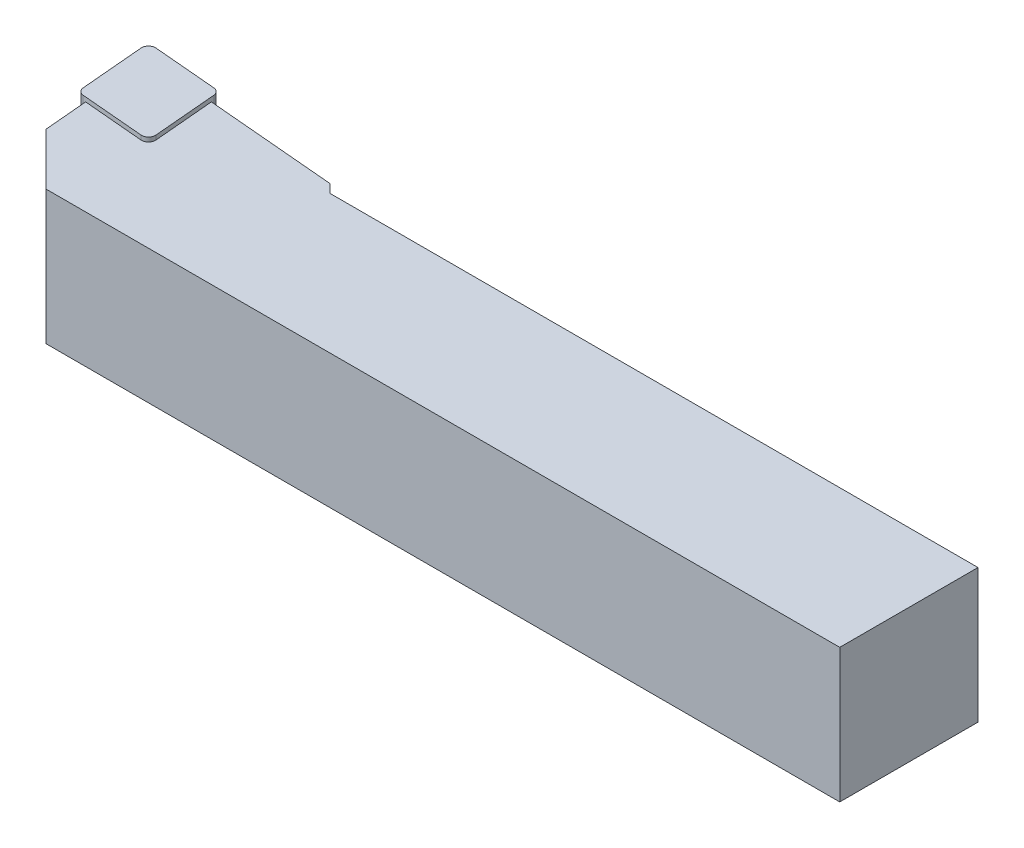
ISO-10303-21;
HEADER;
FILE_DESCRIPTION(('STEP AP214'),'2;1');
FILE_NAME('part.step','',(''),(''),'','','');
FILE_SCHEMA(('AUTOMOTIVE_DESIGN { 1 0 10303 214 1 1 1 1 }'));
ENDSEC;
DATA;
#1=APPLICATION_CONTEXT('core data for automotive mechanical design processes');
#2=APPLICATION_PROTOCOL_DEFINITION('international standard','automotive_design',2000,#1);
#3=PRODUCT_CONTEXT('',#1,'mechanical');
#4=PRODUCT('Part','Part','',(#3));
#5=PRODUCT_RELATED_PRODUCT_CATEGORY('part','',(#4));
#6=PRODUCT_DEFINITION_FORMATION('','',#4);
#7=PRODUCT_DEFINITION_CONTEXT('part definition',#1,'design');
#8=PRODUCT_DEFINITION('design','',#6,#7);
#9=PRODUCT_DEFINITION_SHAPE('','',#8);
#10=(LENGTH_UNIT() NAMED_UNIT(*) SI_UNIT(.MILLI.,.METRE.));
#11=(NAMED_UNIT(*) PLANE_ANGLE_UNIT() SI_UNIT($,.RADIAN.));
#12=(NAMED_UNIT(*) SI_UNIT($,.STERADIAN.) SOLID_ANGLE_UNIT());
#13=UNCERTAINTY_MEASURE_WITH_UNIT(LENGTH_MEASURE(1.E-05),#10,'distance_accuracy_value','');
#14=(GEOMETRIC_REPRESENTATION_CONTEXT(3) GLOBAL_UNCERTAINTY_ASSIGNED_CONTEXT((#13)) GLOBAL_UNIT_ASSIGNED_CONTEXT((#10,
#11,#12)) REPRESENTATION_CONTEXT('',''));
#15=CARTESIAN_POINT('',(0.,0.,0.));
#16=DIRECTION('',(0.,0.,1.));
#17=DIRECTION('',(1.,0.,0.));
#18=AXIS2_PLACEMENT_3D('',#15,#16,#17);
#19=CARTESIAN_POINT('',(0.800000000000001,-4.76,0.8));
#20=DIRECTION('',(0.,1.,0.));
#21=DIRECTION('',(0.,0.,1.));
#22=AXIS2_PLACEMENT_3D('',#19,#20,#21);
#23=CYLINDRICAL_SURFACE('',#22,0.8);
#24=CARTESIAN_POINT('',(0.800000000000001,0.,0.8));
#25=DIRECTION('',(0.,1.,0.));
#26=DIRECTION('',(0.,0.,1.));
#27=AXIS2_PLACEMENT_3D('',#24,#25,#26);
#28=CIRCLE('',#27,0.8);
#29=CARTESIAN_POINT('',(0.869724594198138,0.,0.00304424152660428));
#30=VERTEX_POINT('',#29);
#31=CARTESIAN_POINT('',(0.00304424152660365,0.,0.869724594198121));
#32=VERTEX_POINT('',#31);
#33=EDGE_CURVE('E138',#30,#32,#28,.T.);
#34=ORIENTED_EDGE('',*,*,#33,.F.);
#35=DIRECTION('',(0.,1.,0.));
#36=VECTOR('',#35,1.);
#37=CARTESIAN_POINT('',(0.869724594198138,-4.76,0.00304424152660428));
#38=LINE('',#37,#36);
#39=CARTESIAN_POINT('',(0.869724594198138,-4.76,0.00304424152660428));
#40=VERTEX_POINT('',#39);
#41=EDGE_CURVE('E54',#40,#30,#38,.T.);
#42=ORIENTED_EDGE('',*,*,#41,.F.);
#43=CARTESIAN_POINT('',(0.800000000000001,-4.76,0.8));
#44=DIRECTION('',(0.,1.,0.));
#45=DIRECTION('',(0.,0.,1.));
#46=AXIS2_PLACEMENT_3D('',#43,#44,#45);
#47=CIRCLE('',#46,0.8);
#48=CARTESIAN_POINT('',(0.00304424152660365,-4.76,0.869724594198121));
#49=VERTEX_POINT('',#48);
#50=EDGE_CURVE('E160',#40,#49,#47,.T.);
#51=ORIENTED_EDGE('',*,*,#50,.T.);
#52=DIRECTION('',(0.,1.,0.));
#53=VECTOR('',#52,1.);
#54=CARTESIAN_POINT('',(0.00304424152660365,-4.76,0.869724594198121));
#55=LINE('',#54,#53);
#56=EDGE_CURVE('E93',#49,#32,#55,.T.);
#57=ORIENTED_EDGE('',*,*,#56,.T.);
#58=EDGE_LOOP('',(#34,#42,#51,#57));
#59=FACE_BOUND('',#58,.T.);
#60=ADVANCED_FACE('F31',(#59),#23,.T.);
#61=CARTESIAN_POINT('',(0.869724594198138,-4.76,0.00304424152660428));
#62=DIRECTION('',(0.0871557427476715,0.,-0.996194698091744));
#63=DIRECTION('',(-0.996194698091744,0.,-0.0871557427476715));
#64=AXIS2_PLACEMENT_3D('',#61,#62,#63);
#65=PLANE('',#64);
#66=DIRECTION('',(-0.996194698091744,0.,-0.0871557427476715));
#67=VECTOR('',#66,1.);
#68=CARTESIAN_POINT('',(0.869724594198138,0.,0.00304424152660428));
#69=LINE('',#68,#67);
#70=CARTESIAN_POINT('',(8.21697670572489,0.,0.645845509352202));
#71=VERTEX_POINT('',#70);
#72=EDGE_CURVE('E157',#71,#30,#69,.T.);
#73=ORIENTED_EDGE('',*,*,#72,.F.);
#74=DIRECTION('',(0.,1.,0.));
#75=VECTOR('',#74,1.);
#76=CARTESIAN_POINT('',(8.21697670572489,-4.76,0.645845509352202));
#77=LINE('',#76,#75);
#78=CARTESIAN_POINT('',(8.21697670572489,-4.76,0.645845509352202));
#79=VERTEX_POINT('',#78);
#80=EDGE_CURVE('E129',#79,#71,#77,.T.);
#81=ORIENTED_EDGE('',*,*,#80,.F.);
#82=DIRECTION('',(-0.996194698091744,0.,-0.0871557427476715));
#83=VECTOR('',#82,1.);
#84=CARTESIAN_POINT('',(0.869724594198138,-4.76,0.00304424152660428));
#85=LINE('',#84,#83);
#86=EDGE_CURVE('E133',#79,#40,#85,.T.);
#87=ORIENTED_EDGE('',*,*,#86,.T.);
#88=ORIENTED_EDGE('',*,*,#41,.T.);
#89=EDGE_LOOP('',(#73,#81,#87,#88));
#90=FACE_BOUND('',#89,.T.);
#91=ADVANCED_FACE('F333',(#90),#65,.T.);
#92=CARTESIAN_POINT('',(8.14725211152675,-4.76,1.4428012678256));
#93=DIRECTION('',(0.,1.,0.));
#94=DIRECTION('',(0.,0.,1.));
#95=AXIS2_PLACEMENT_3D('',#92,#93,#94);
#96=CYLINDRICAL_SURFACE('',#95,0.799999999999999);
#97=CARTESIAN_POINT('',(8.14725211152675,0.,1.4428012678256));
#98=DIRECTION('',(0.,1.,0.));
#99=DIRECTION('',(0.,0.,-1.));
#100=AXIS2_PLACEMENT_3D('',#97,#98,#99);
#101=CIRCLE('',#100,0.799999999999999);
#102=CARTESIAN_POINT('',(8.94420787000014,0.,1.37307667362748));
#103=VERTEX_POINT('',#102);
#104=EDGE_CURVE('E127',#103,#71,#101,.T.);
#105=ORIENTED_EDGE('',*,*,#104,.F.);
#106=DIRECTION('',(0.,1.,0.));
#107=VECTOR('',#106,1.);
#108=CARTESIAN_POINT('',(8.94420787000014,-4.76,1.37307667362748));
#109=LINE('',#108,#107);
#110=CARTESIAN_POINT('',(8.94420787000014,-4.76,1.37307667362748));
#111=VERTEX_POINT('',#110);
#112=EDGE_CURVE('E110',#111,#103,#109,.T.);
#113=ORIENTED_EDGE('',*,*,#112,.F.);
#114=CARTESIAN_POINT('',(8.14725211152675,-4.76,1.4428012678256));
#115=DIRECTION('',(0.,1.,0.));
#116=DIRECTION('',(0.,0.,-1.));
#117=AXIS2_PLACEMENT_3D('',#114,#115,#116);
#118=CIRCLE('',#117,0.799999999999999);
#119=EDGE_CURVE('E119',#111,#79,#118,.T.);
#120=ORIENTED_EDGE('',*,*,#119,.T.);
#121=ORIENTED_EDGE('',*,*,#80,.T.);
#122=EDGE_LOOP('',(#105,#113,#120,#121));
#123=FACE_BOUND('',#122,.T.);
#124=ADVANCED_FACE('F124',(#123),#96,.T.);
#125=CARTESIAN_POINT('',(8.94420787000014,-4.76,1.37307667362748));
#126=DIRECTION('',(0.996194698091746,0.,-0.0871557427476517));
#127=DIRECTION('',(-0.0871557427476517,0.,-0.996194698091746));
#128=AXIS2_PLACEMENT_3D('',#125,#126,#127);
#129=PLANE('',#128);
#130=DIRECTION('',(0.,1.,0.));
#131=VECTOR('',#130,1.);
#132=CARTESIAN_POINT('',(8.97259223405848,-4.76,1.69751143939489));
#133=LINE('',#132,#131);
#134=CARTESIAN_POINT('',(8.97259223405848,-4.76,1.69751143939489));
#135=VERTEX_POINT('',#134);
#136=CARTESIAN_POINT('',(8.97259223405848,-0.5,1.69751143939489));
#137=VERTEX_POINT('',#136);
#138=EDGE_CURVE('E115',#135,#137,#133,.T.);
#139=ORIENTED_EDGE('',*,*,#138,.F.);
#140=DIRECTION('',(-0.0871557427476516,0.,-0.996194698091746));
#141=VECTOR('',#140,1.);
#142=CARTESIAN_POINT('',(8.94420787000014,-4.76,1.37307667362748));
#143=LINE('',#142,#141);
#144=EDGE_CURVE('E106',#135,#111,#143,.T.);
#145=ORIENTED_EDGE('',*,*,#144,.T.);
#146=ORIENTED_EDGE('',*,*,#112,.T.);
#147=DIRECTION('',(-0.0871557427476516,0.,-0.996194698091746));
#148=VECTOR('',#147,1.);
#149=CARTESIAN_POINT('',(8.94420787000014,0.,1.37307667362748));
#150=LINE('',#149,#148);
#151=CARTESIAN_POINT('',(9.58700913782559,0.,8.72032878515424));
#152=VERTEX_POINT('',#151);
#153=EDGE_CURVE('E154',#152,#103,#150,.T.);
#154=ORIENTED_EDGE('',*,*,#153,.F.);
#155=DIRECTION('',(0.,1.,0.));
#156=VECTOR('',#155,1.);
#157=CARTESIAN_POINT('',(9.58700913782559,-4.76,8.72032878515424));
#158=LINE('',#157,#156);
#159=CARTESIAN_POINT('',(9.58700913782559,-0.5,8.72032878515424));
#160=VERTEX_POINT('',#159);
#161=EDGE_CURVE('E130',#160,#152,#158,.T.);
#162=ORIENTED_EDGE('',*,*,#161,.F.);
#163=DIRECTION('',(0.0871557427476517,0.,0.996194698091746));
#164=VECTOR('',#163,1.);
#165=CARTESIAN_POINT('',(8.94420787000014,-0.5,1.37307667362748));
#166=LINE('',#165,#164);
#167=EDGE_CURVE('E142',#137,#160,#166,.T.);
#168=ORIENTED_EDGE('',*,*,#167,.F.);
#169=EDGE_LOOP('',(#139,#145,#146,#154,#162,#168));
#170=FACE_BOUND('',#169,.T.);
#171=ADVANCED_FACE('F108',(#170),#129,.T.);
#172=CARTESIAN_POINT('',(8.7900533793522,-4.76,8.79005337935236));
#173=DIRECTION('',(0.,1.,0.));
#174=DIRECTION('',(0.,0.,1.));
#175=AXIS2_PLACEMENT_3D('',#172,#173,#174);
#176=CYLINDRICAL_SURFACE('',#175,0.799999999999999);
#177=CARTESIAN_POINT('',(8.7900533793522,-0.5,8.79005337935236));
#178=DIRECTION('',(0.,1.,0.));
#179=DIRECTION('',(0.,0.,1.));
#180=AXIS2_PLACEMENT_3D('',#177,#178,#179);
#181=CIRCLE('',#180,0.799999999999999);
#182=CARTESIAN_POINT('',(8.72032878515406,-0.5,9.58700913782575));
#183=VERTEX_POINT('',#182);
#184=EDGE_CURVE('E197',#160,#183,#181,.F.);
#185=ORIENTED_EDGE('',*,*,#184,.F.);
#186=ORIENTED_EDGE('',*,*,#161,.T.);
#187=CARTESIAN_POINT('',(8.7900533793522,0.,8.79005337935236));
#188=DIRECTION('',(0.,1.,0.));
#189=DIRECTION('',(0.,0.,-1.));
#190=AXIS2_PLACEMENT_3D('',#187,#188,#189);
#191=CIRCLE('',#190,0.799999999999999);
#192=CARTESIAN_POINT('',(8.72032878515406,0.,9.58700913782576));
#193=VERTEX_POINT('',#192);
#194=EDGE_CURVE('E151',#193,#152,#191,.T.);
#195=ORIENTED_EDGE('',*,*,#194,.F.);
#196=DIRECTION('',(0.,1.,0.));
#197=VECTOR('',#196,1.);
#198=CARTESIAN_POINT('',(8.72032878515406,-4.76,9.58700913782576));
#199=LINE('',#198,#197);
#200=EDGE_CURVE('E165',#183,#193,#199,.T.);
#201=ORIENTED_EDGE('',*,*,#200,.F.);
#202=EDGE_LOOP('',(#185,#186,#195,#201));
#203=FACE_BOUND('',#202,.T.);
#204=ADVANCED_FACE('F325',(#203),#176,.T.);
#205=CARTESIAN_POINT('',(8.72032878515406,-4.76,9.58700913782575));
#206=DIRECTION('',(-0.0871557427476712,0.,0.996194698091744));
#207=DIRECTION('',(0.996194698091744,0.,0.0871557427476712));
#208=AXIS2_PLACEMENT_3D('',#205,#206,#207);
#209=PLANE('',#208);
#210=DIRECTION('',(0.,-1.,0.));
#211=VECTOR('',#210,1.);
#212=CARTESIAN_POINT('',(1.69751143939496,-4.76,8.97259223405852));
#213=LINE('',#212,#211);
#214=CARTESIAN_POINT('',(1.69751143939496,-0.5,8.97259223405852));
#215=VERTEX_POINT('',#214);
#216=CARTESIAN_POINT('',(1.69751143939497,-4.76,8.97259223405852));
#217=VERTEX_POINT('',#216);
#218=EDGE_CURVE('E187',#215,#217,#213,.T.);
#219=ORIENTED_EDGE('',*,*,#218,.F.);
#220=DIRECTION('',(-0.996194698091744,0.,-0.0871557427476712));
#221=VECTOR('',#220,1.);
#222=CARTESIAN_POINT('',(8.72032878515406,-0.5,9.58700913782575));
#223=LINE('',#222,#221);
#224=EDGE_CURVE('E11',#183,#215,#223,.T.);
#225=ORIENTED_EDGE('',*,*,#224,.F.);
#226=ORIENTED_EDGE('',*,*,#200,.T.);
#227=DIRECTION('',(0.996194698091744,0.,0.0871557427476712));
#228=VECTOR('',#227,1.);
#229=CARTESIAN_POINT('',(8.72032878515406,0.,9.58700913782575));
#230=LINE('',#229,#228);
#231=CARTESIAN_POINT('',(1.37307667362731,0.,8.94420787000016));
#232=VERTEX_POINT('',#231);
#233=EDGE_CURVE('E148',#232,#193,#230,.T.);
#234=ORIENTED_EDGE('',*,*,#233,.F.);
#235=DIRECTION('',(0.,1.,0.));
#236=VECTOR('',#235,1.);
#237=CARTESIAN_POINT('',(1.37307667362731,-4.76,8.94420787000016));
#238=LINE('',#237,#236);
#239=CARTESIAN_POINT('',(1.37307667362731,-4.76,8.94420787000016));
#240=VERTEX_POINT('',#239);
#241=EDGE_CURVE('E167',#240,#232,#238,.T.);
#242=ORIENTED_EDGE('',*,*,#241,.F.);
#243=DIRECTION('',(0.996194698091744,0.,0.0871557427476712));
#244=VECTOR('',#243,1.);
#245=CARTESIAN_POINT('',(8.72032878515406,-4.76,9.58700913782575));
#246=LINE('',#245,#244);
#247=EDGE_CURVE('E120',#240,#217,#246,.T.);
#248=ORIENTED_EDGE('',*,*,#247,.T.);
#249=EDGE_LOOP('',(#219,#225,#226,#234,#242,#248));
#250=FACE_BOUND('',#249,.T.);
#251=ADVANCED_FACE('F185',(#250),#209,.T.);
#252=CARTESIAN_POINT('',(1.44280126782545,-4.76,8.14725211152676));
#253=DIRECTION('',(0.,1.,0.));
#254=DIRECTION('',(0.,0.,1.));
#255=AXIS2_PLACEMENT_3D('',#252,#253,#254);
#256=CYLINDRICAL_SURFACE('',#255,0.8);
#257=CARTESIAN_POINT('',(1.44280126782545,0.,8.14725211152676));
#258=DIRECTION('',(0.,1.,0.));
#259=DIRECTION('',(0.,0.,-1.));
#260=AXIS2_PLACEMENT_3D('',#257,#258,#259);
#261=CIRCLE('',#260,0.8);
#262=CARTESIAN_POINT('',(0.645845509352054,0.,8.21697670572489));
#263=VERTEX_POINT('',#262);
#264=EDGE_CURVE('E145',#263,#232,#261,.T.);
#265=ORIENTED_EDGE('',*,*,#264,.F.);
#266=DIRECTION('',(0.,1.,0.));
#267=VECTOR('',#266,1.);
#268=CARTESIAN_POINT('',(0.645845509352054,-4.76,8.21697670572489));
#269=LINE('',#268,#267);
#270=CARTESIAN_POINT('',(0.645845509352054,-4.76,8.21697670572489));
#271=VERTEX_POINT('',#270);
#272=EDGE_CURVE('E169',#271,#263,#269,.T.);
#273=ORIENTED_EDGE('',*,*,#272,.F.);
#274=CARTESIAN_POINT('',(1.44280126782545,-4.76,8.14725211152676));
#275=DIRECTION('',(0.,1.,0.));
#276=DIRECTION('',(0.,0.,-1.));
#277=AXIS2_PLACEMENT_3D('',#274,#275,#276);
#278=CIRCLE('',#277,0.8);
#279=EDGE_CURVE('E189',#271,#240,#278,.T.);
#280=ORIENTED_EDGE('',*,*,#279,.T.);
#281=ORIENTED_EDGE('',*,*,#241,.T.);
#282=EDGE_LOOP('',(#265,#273,#280,#281));
#283=FACE_BOUND('',#282,.T.);
#284=ADVANCED_FACE('F331',(#283),#256,.T.);
#285=CARTESIAN_POINT('',(0.645845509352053,-4.76,8.21697670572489));
#286=DIRECTION('',(-0.996194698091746,0.,0.0871557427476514));
#287=DIRECTION('',(0.0871557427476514,0.,0.996194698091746));
#288=AXIS2_PLACEMENT_3D('',#285,#286,#287);
#289=PLANE('',#288);
#290=DIRECTION('',(0.0871557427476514,0.,0.996194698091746));
#291=VECTOR('',#290,1.);
#292=CARTESIAN_POINT('',(0.645845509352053,0.,8.21697670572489));
#293=LINE('',#292,#291);
#294=EDGE_CURVE('E141',#32,#263,#293,.T.);
#295=ORIENTED_EDGE('',*,*,#294,.F.);
#296=ORIENTED_EDGE('',*,*,#56,.F.);
#297=DIRECTION('',(0.0871557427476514,0.,0.996194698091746));
#298=VECTOR('',#297,1.);
#299=CARTESIAN_POINT('',(0.645845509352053,-4.76,8.21697670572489));
#300=LINE('',#299,#298);
#301=EDGE_CURVE('E190',#49,#271,#300,.T.);
#302=ORIENTED_EDGE('',*,*,#301,.T.);
#303=ORIENTED_EDGE('',*,*,#272,.T.);
#304=EDGE_LOOP('',(#295,#296,#302,#303));
#305=FACE_BOUND('',#304,.T.);
#306=ADVANCED_FACE('F332',(#305),#289,.T.);
#307=CARTESIAN_POINT('',(0.800000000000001,-4.76,0.8));
#308=DIRECTION('',(0.,1.,0.));
#309=DIRECTION('',(0.,0.,1.));
#310=AXIS2_PLACEMENT_3D('',#307,#308,#309);
#311=PLANE('',#310);
#312=DIRECTION('',(-0.996194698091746,0.,-0.0871557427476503));
#313=VECTOR('',#312,1.);
#314=CARTESIAN_POINT('',(0.784154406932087,-4.76,0.981115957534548));
#315=LINE('',#314,#313);
#316=CARTESIAN_POINT('',(0.999999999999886,-4.76,1.00000000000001));
#317=VERTEX_POINT('',#316);
#318=EDGE_CURVE('E162',#135,#317,#315,.T.);
#319=ORIENTED_EDGE('',*,*,#318,.T.);
#320=DIRECTION('',(0.0871557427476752,0.,0.996194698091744));
#321=VECTOR('',#320,1.);
#322=CARTESIAN_POINT('',(0.98111595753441,-4.76,0.784154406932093));
#323=LINE('',#322,#321);
#324=EDGE_CURVE('E38',#317,#217,#323,.T.);
#325=ORIENTED_EDGE('',*,*,#324,.T.);
#326=ORIENTED_EDGE('',*,*,#247,.F.);
#327=ORIENTED_EDGE('',*,*,#279,.F.);
#328=ORIENTED_EDGE('',*,*,#301,.F.);
#329=ORIENTED_EDGE('',*,*,#50,.F.);
#330=ORIENTED_EDGE('',*,*,#86,.F.);
#331=ORIENTED_EDGE('',*,*,#119,.F.);
#332=ORIENTED_EDGE('',*,*,#144,.F.);
#333=EDGE_LOOP('',(#319,#325,#326,#327,#328,#329,#330,#331,#332));
#334=FACE_BOUND('',#333,.T.);
#335=ADVANCED_FACE('F132',(#334),#311,.F.);
#336=CARTESIAN_POINT('',(0.800000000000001,0.,0.8));
#337=DIRECTION('',(0.,1.,0.));
#338=DIRECTION('',(0.,0.,1.));
#339=AXIS2_PLACEMENT_3D('',#336,#337,#338);
#340=PLANE('',#339);
#341=ORIENTED_EDGE('',*,*,#33,.T.);
#342=ORIENTED_EDGE('',*,*,#294,.T.);
#343=ORIENTED_EDGE('',*,*,#264,.T.);
#344=ORIENTED_EDGE('',*,*,#233,.T.);
#345=ORIENTED_EDGE('',*,*,#194,.T.);
#346=ORIENTED_EDGE('',*,*,#153,.T.);
#347=ORIENTED_EDGE('',*,*,#104,.T.);
#348=ORIENTED_EDGE('',*,*,#72,.T.);
#349=EDGE_LOOP('',(#341,#342,#343,#344,#345,#346,#347,#348));
#350=FACE_BOUND('',#349,.T.);
#351=ADVANCED_FACE('F328',(#350),#340,.T.);
#352=CARTESIAN_POINT('',(100.,-16.,4.));
#353=DIRECTION('',(0.,0.,-1.));
#354=DIRECTION('',(-1.,0.,0.));
#355=AXIS2_PLACEMENT_3D('',#352,#353,#354);
#356=PLANE('',#355);
#357=DIRECTION('',(-1.,0.,0.));
#358=VECTOR('',#357,1.);
#359=CARTESIAN_POINT('',(100.,-0.5,4.));
#360=LINE('',#359,#358);
#361=CARTESIAN_POINT('',(100.,-0.5,4.));
#362=VERTEX_POINT('',#361);
#363=CARTESIAN_POINT('',(25.,-0.5,4.));
#364=VERTEX_POINT('',#363);
#365=EDGE_CURVE('E241',#362,#364,#360,.T.);
#366=ORIENTED_EDGE('',*,*,#365,.F.);
#367=DIRECTION('',(0.,1.,0.));
#368=VECTOR('',#367,1.);
#369=CARTESIAN_POINT('',(100.,-16.,4.));
#370=LINE('',#369,#368);
#371=CARTESIAN_POINT('',(100.,-16.,4.));
#372=VERTEX_POINT('',#371);
#373=EDGE_CURVE('E202',#372,#362,#370,.T.);
#374=ORIENTED_EDGE('',*,*,#373,.F.);
#375=DIRECTION('',(-1.,0.,0.));
#376=VECTOR('',#375,1.);
#377=CARTESIAN_POINT('',(100.,-16.,4.));
#378=LINE('',#377,#376);
#379=CARTESIAN_POINT('',(25.,-16.,4.));
#380=VERTEX_POINT('',#379);
#381=EDGE_CURVE('E225',#372,#380,#378,.T.);
#382=ORIENTED_EDGE('',*,*,#381,.T.);
#383=DIRECTION('',(0.,1.,0.));
#384=VECTOR('',#383,1.);
#385=CARTESIAN_POINT('',(25.,-16.,4.));
#386=LINE('',#385,#384);
#387=EDGE_CURVE('E203',#380,#364,#386,.T.);
#388=ORIENTED_EDGE('',*,*,#387,.T.);
#389=EDGE_LOOP('',(#366,#374,#382,#388));
#390=FACE_BOUND('',#389,.T.);
#391=ADVANCED_FACE('F266',(#390),#356,.T.);
#392=CARTESIAN_POINT('',(100.,-16.,4.));
#393=DIRECTION('',(1.,0.,0.));
#394=DIRECTION('',(0.,0.,-1.));
#395=AXIS2_PLACEMENT_3D('',#392,#393,#394);
#396=PLANE('',#395);
#397=DIRECTION('',(0.,0.,-1.));
#398=VECTOR('',#397,1.);
#399=CARTESIAN_POINT('',(100.,-0.5,4.));
#400=LINE('',#399,#398);
#401=CARTESIAN_POINT('',(100.,-0.5,20.));
#402=VERTEX_POINT('',#401);
#403=EDGE_CURVE('E222',#402,#362,#400,.T.);
#404=ORIENTED_EDGE('',*,*,#403,.F.);
#405=DIRECTION('',(0.,1.,0.));
#406=VECTOR('',#405,1.);
#407=CARTESIAN_POINT('',(100.,-16.,20.));
#408=LINE('',#407,#406);
#409=CARTESIAN_POINT('',(100.,-16.,20.));
#410=VERTEX_POINT('',#409);
#411=EDGE_CURVE('E217',#410,#402,#408,.T.);
#412=ORIENTED_EDGE('',*,*,#411,.F.);
#413=DIRECTION('',(0.,0.,-1.));
#414=VECTOR('',#413,1.);
#415=CARTESIAN_POINT('',(100.,-16.,4.));
#416=LINE('',#415,#414);
#417=EDGE_CURVE('E207',#410,#372,#416,.T.);
#418=ORIENTED_EDGE('',*,*,#417,.T.);
#419=ORIENTED_EDGE('',*,*,#373,.T.);
#420=EDGE_LOOP('',(#404,#412,#418,#419));
#421=FACE_BOUND('',#420,.T.);
#422=ADVANCED_FACE('F286',(#421),#396,.T.);
#423=CARTESIAN_POINT('',(100.,-16.,20.));
#424=DIRECTION('',(0.,0.,1.));
#425=DIRECTION('',(1.,0.,0.));
#426=AXIS2_PLACEMENT_3D('',#423,#424,#425);
#427=PLANE('',#426);
#428=DIRECTION('',(1.,0.,0.));
#429=VECTOR('',#428,1.);
#430=CARTESIAN_POINT('',(100.,-0.5,20.));
#431=LINE('',#430,#429);
#432=CARTESIAN_POINT('',(8.13735262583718,-0.5,20.));
#433=VERTEX_POINT('',#432);
#434=EDGE_CURVE('E226',#433,#402,#431,.T.);
#435=ORIENTED_EDGE('',*,*,#434,.F.);
#436=DIRECTION('',(0.,1.,0.));
#437=VECTOR('',#436,1.);
#438=CARTESIAN_POINT('',(8.13735262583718,-16.,20.));
#439=LINE('',#438,#437);
#440=CARTESIAN_POINT('',(8.13735262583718,-16.,20.));
#441=VERTEX_POINT('',#440);
#442=EDGE_CURVE('E214',#441,#433,#439,.T.);
#443=ORIENTED_EDGE('',*,*,#442,.F.);
#444=DIRECTION('',(1.,0.,0.));
#445=VECTOR('',#444,1.);
#446=CARTESIAN_POINT('',(100.,-16.,20.));
#447=LINE('',#446,#445);
#448=EDGE_CURVE('E246',#441,#410,#447,.T.);
#449=ORIENTED_EDGE('',*,*,#448,.T.);
#450=ORIENTED_EDGE('',*,*,#411,.T.);
#451=EDGE_LOOP('',(#435,#443,#449,#450));
#452=FACE_BOUND('',#451,.T.);
#453=ADVANCED_FACE('F293',(#452),#427,.T.);
#454=CARTESIAN_POINT('',(2.13735262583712,-16.,14.));
#455=DIRECTION('',(-0.707106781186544,0.,0.707106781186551));
#456=DIRECTION('',(0.707106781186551,0.,0.707106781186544));
#457=AXIS2_PLACEMENT_3D('',#454,#455,#456);
#458=PLANE('',#457);
#459=DIRECTION('',(0.707106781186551,0.,0.707106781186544));
#460=VECTOR('',#459,1.);
#461=CARTESIAN_POINT('',(2.13735262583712,-0.5,14.));
#462=LINE('',#461,#460);
#463=CARTESIAN_POINT('',(2.13735262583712,-0.5,14.));
#464=VERTEX_POINT('',#463);
#465=EDGE_CURVE('E229',#464,#433,#462,.T.);
#466=ORIENTED_EDGE('',*,*,#465,.F.);
#467=DIRECTION('',(0.,1.,0.));
#468=VECTOR('',#467,1.);
#469=CARTESIAN_POINT('',(2.13735262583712,-16.,14.));
#470=LINE('',#469,#468);
#471=CARTESIAN_POINT('',(2.13735262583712,-16.,14.));
#472=VERTEX_POINT('',#471);
#473=EDGE_CURVE('E211',#472,#464,#470,.T.);
#474=ORIENTED_EDGE('',*,*,#473,.F.);
#475=DIRECTION('',(0.707106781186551,0.,0.707106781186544));
#476=VECTOR('',#475,1.);
#477=CARTESIAN_POINT('',(2.13735262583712,-16.,14.));
#478=LINE('',#477,#476);
#479=EDGE_CURVE('E249',#472,#441,#478,.T.);
#480=ORIENTED_EDGE('',*,*,#479,.T.);
#481=ORIENTED_EDGE('',*,*,#442,.T.);
#482=EDGE_LOOP('',(#466,#474,#480,#481));
#483=FACE_BOUND('',#482,.T.);
#484=ADVANCED_FACE('F301',(#483),#458,.T.);
#485=CARTESIAN_POINT('',(0.999999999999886,-16.,1.00000000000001));
#486=DIRECTION('',(-0.996194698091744,0.,0.0871557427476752));
#487=DIRECTION('',(0.0871557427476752,0.,0.996194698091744));
#488=AXIS2_PLACEMENT_3D('',#485,#486,#487);
#489=PLANE('',#488);
#490=DIRECTION('',(0.0871557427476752,0.,0.996194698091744));
#491=VECTOR('',#490,1.);
#492=CARTESIAN_POINT('',(0.999999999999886,-0.5,1.00000000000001));
#493=LINE('',#492,#491);
#494=EDGE_CURVE('E232',#215,#464,#493,.T.);
#495=ORIENTED_EDGE('',*,*,#494,.F.);
#496=ORIENTED_EDGE('',*,*,#218,.T.);
#497=ORIENTED_EDGE('',*,*,#324,.F.);
#498=DIRECTION('',(0.,1.,0.));
#499=VECTOR('',#498,1.);
#500=CARTESIAN_POINT('',(0.999999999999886,-16.,1.00000000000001));
#501=LINE('',#500,#499);
#502=CARTESIAN_POINT('',(0.999999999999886,-16.,1.00000000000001));
#503=VERTEX_POINT('',#502);
#504=EDGE_CURVE('E45',#503,#317,#501,.T.);
#505=ORIENTED_EDGE('',*,*,#504,.F.);
#506=DIRECTION('',(0.0871557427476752,0.,0.996194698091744));
#507=VECTOR('',#506,1.);
#508=CARTESIAN_POINT('',(0.999999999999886,-16.,1.00000000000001));
#509=LINE('',#508,#507);
#510=EDGE_CURVE('E252',#503,#472,#509,.T.);
#511=ORIENTED_EDGE('',*,*,#510,.T.);
#512=ORIENTED_EDGE('',*,*,#473,.T.);
#513=EDGE_LOOP('',(#495,#496,#497,#505,#511,#512));
#514=FACE_BOUND('',#513,.T.);
#515=ADVANCED_FACE('F307',(#514),#489,.T.);
#516=CARTESIAN_POINT('',(0.999999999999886,-16.,1.00000000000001));
#517=DIRECTION('',(0.0871557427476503,0.,-0.996194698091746));
#518=DIRECTION('',(-0.996194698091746,0.,-0.0871557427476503));
#519=AXIS2_PLACEMENT_3D('',#516,#517,#518);
#520=PLANE('',#519);
#521=ORIENTED_EDGE('',*,*,#318,.F.);
#522=ORIENTED_EDGE('',*,*,#138,.T.);
#523=DIRECTION('',(-0.996194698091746,0.,-0.0871557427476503));
#524=VECTOR('',#523,1.);
#525=CARTESIAN_POINT('',(0.999999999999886,-0.5,1.00000000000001));
#526=LINE('',#525,#524);
#527=CARTESIAN_POINT('',(24.013412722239,-0.5,3.01341272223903));
#528=VERTEX_POINT('',#527);
#529=EDGE_CURVE('E235',#528,#137,#526,.T.);
#530=ORIENTED_EDGE('',*,*,#529,.F.);
#531=DIRECTION('',(0.,1.,0.));
#532=VECTOR('',#531,1.);
#533=CARTESIAN_POINT('',(24.013412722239,-16.,3.01341272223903));
#534=LINE('',#533,#532);
#535=CARTESIAN_POINT('',(24.013412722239,-16.,3.01341272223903));
#536=VERTEX_POINT('',#535);
#537=EDGE_CURVE('E206',#536,#528,#534,.T.);
#538=ORIENTED_EDGE('',*,*,#537,.F.);
#539=DIRECTION('',(-0.996194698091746,0.,-0.0871557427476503));
#540=VECTOR('',#539,1.);
#541=CARTESIAN_POINT('',(0.999999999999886,-16.,1.00000000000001));
#542=LINE('',#541,#540);
#543=EDGE_CURVE('E255',#536,#503,#542,.T.);
#544=ORIENTED_EDGE('',*,*,#543,.T.);
#545=ORIENTED_EDGE('',*,*,#504,.T.);
#546=EDGE_LOOP('',(#521,#522,#530,#538,#544,#545));
#547=FACE_BOUND('',#546,.T.);
#548=ADVANCED_FACE('F364',(#547),#520,.T.);
#549=CARTESIAN_POINT('',(25.,-16.,4.));
#550=DIRECTION('',(0.707106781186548,0.,-0.707106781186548));
#551=DIRECTION('',(-0.707106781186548,0.,-0.707106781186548));
#552=AXIS2_PLACEMENT_3D('',#549,#550,#551);
#553=PLANE('',#552);
#554=DIRECTION('',(-0.707106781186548,0.,-0.707106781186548));
#555=VECTOR('',#554,1.);
#556=CARTESIAN_POINT('',(25.,-0.5,4.));
#557=LINE('',#556,#555);
#558=EDGE_CURVE('E238',#364,#528,#557,.T.);
#559=ORIENTED_EDGE('',*,*,#558,.F.);
#560=ORIENTED_EDGE('',*,*,#387,.F.);
#561=DIRECTION('',(-0.707106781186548,0.,-0.707106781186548));
#562=VECTOR('',#561,1.);
#563=CARTESIAN_POINT('',(25.,-16.,4.));
#564=LINE('',#563,#562);
#565=EDGE_CURVE('E257',#380,#536,#564,.T.);
#566=ORIENTED_EDGE('',*,*,#565,.T.);
#567=ORIENTED_EDGE('',*,*,#537,.T.);
#568=EDGE_LOOP('',(#559,#560,#566,#567));
#569=FACE_BOUND('',#568,.T.);
#570=ADVANCED_FACE('F361',(#569),#553,.T.);
#571=CARTESIAN_POINT('',(100.,-16.,4.));
#572=DIRECTION('',(0.,1.,0.));
#573=DIRECTION('',(0.,0.,1.));
#574=AXIS2_PLACEMENT_3D('',#571,#572,#573);
#575=PLANE('',#574);
#576=ORIENTED_EDGE('',*,*,#381,.F.);
#577=ORIENTED_EDGE('',*,*,#417,.F.);
#578=ORIENTED_EDGE('',*,*,#448,.F.);
#579=ORIENTED_EDGE('',*,*,#479,.F.);
#580=ORIENTED_EDGE('',*,*,#510,.F.);
#581=ORIENTED_EDGE('',*,*,#543,.F.);
#582=ORIENTED_EDGE('',*,*,#565,.F.);
#583=EDGE_LOOP('',(#576,#577,#578,#579,#580,#581,#582));
#584=FACE_BOUND('',#583,.T.);
#585=ADVANCED_FACE('F277',(#584),#575,.F.);
#586=CARTESIAN_POINT('',(100.,-0.5,4.));
#587=DIRECTION('',(0.,1.,0.));
#588=DIRECTION('',(0.,0.,1.));
#589=AXIS2_PLACEMENT_3D('',#586,#587,#588);
#590=PLANE('',#589);
#591=ORIENTED_EDGE('',*,*,#529,.T.);
#592=ORIENTED_EDGE('',*,*,#167,.T.);
#593=ORIENTED_EDGE('',*,*,#184,.T.);
#594=ORIENTED_EDGE('',*,*,#224,.T.);
#595=ORIENTED_EDGE('',*,*,#494,.T.);
#596=ORIENTED_EDGE('',*,*,#465,.T.);
#597=ORIENTED_EDGE('',*,*,#434,.T.);
#598=ORIENTED_EDGE('',*,*,#403,.T.);
#599=ORIENTED_EDGE('',*,*,#365,.T.);
#600=ORIENTED_EDGE('',*,*,#558,.T.);
#601=EDGE_LOOP('',(#591,#592,#593,#594,#595,#596,#597,#598,#599,#600));
#602=FACE_BOUND('',#601,.T.);
#603=ADVANCED_FACE('F320',(#602),#590,.T.);
#604=CLOSED_SHELL('',(#60,#91,#124,#171,#204,#251,#284,#306,#335,#351,#391,#422,#453,#484,#515,
#548,#570,#585,#603));
#605=MANIFOLD_SOLID_BREP('B2',#604);
#606=ADVANCED_BREP_SHAPE_REPRESENTATION('',(#18,#605),#14);
#607=SHAPE_DEFINITION_REPRESENTATION(#9,#606);
ENDSEC;
END-ISO-10303-21;
